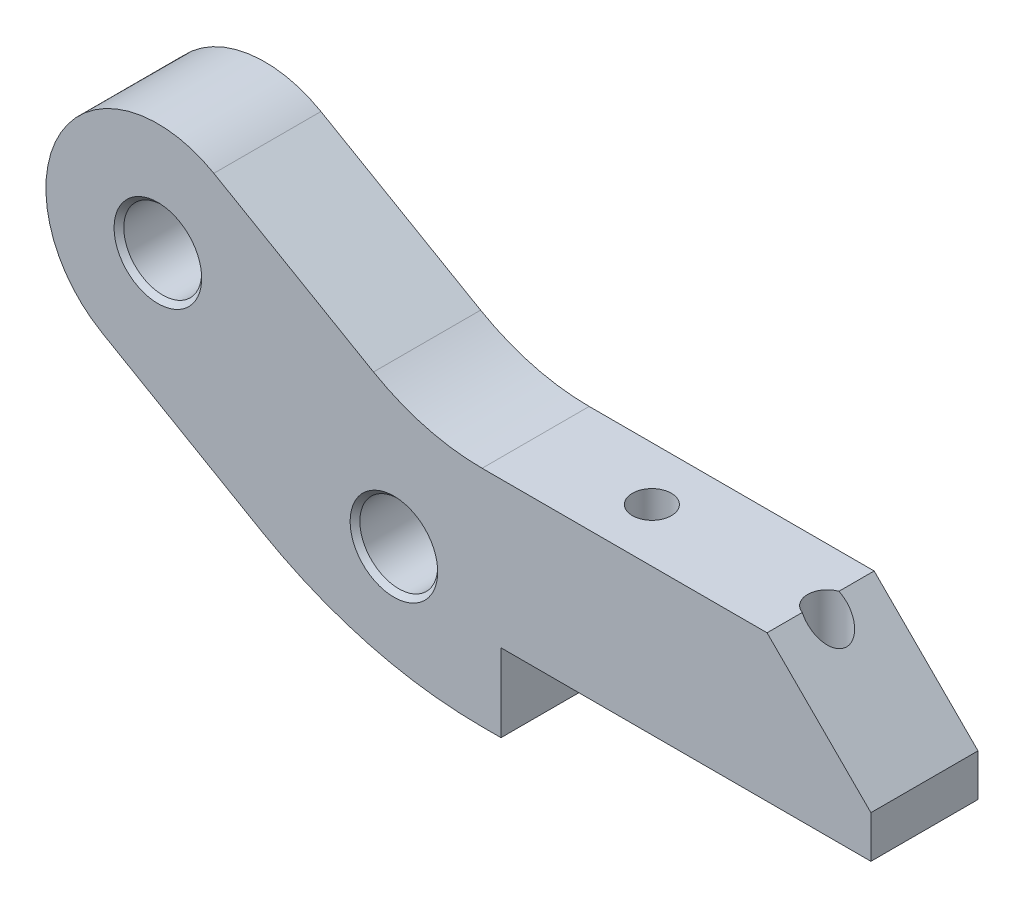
ISO-10303-21;
HEADER;
FILE_DESCRIPTION(('STEP AP214'),'2;1');
FILE_NAME('part.step','',(''),(''),'','','');
FILE_SCHEMA(('AUTOMOTIVE_DESIGN { 1 0 10303 214 1 1 1 1 }'));
ENDSEC;
DATA;
#1=APPLICATION_CONTEXT('core data for automotive mechanical design processes');
#2=APPLICATION_PROTOCOL_DEFINITION('international standard','automotive_design',2000,#1);
#3=PRODUCT_CONTEXT('',#1,'mechanical');
#4=PRODUCT('Part','Part','',(#3));
#5=PRODUCT_RELATED_PRODUCT_CATEGORY('part','',(#4));
#6=PRODUCT_DEFINITION_FORMATION('','',#4);
#7=PRODUCT_DEFINITION_CONTEXT('part definition',#1,'design');
#8=PRODUCT_DEFINITION('design','',#6,#7);
#9=PRODUCT_DEFINITION_SHAPE('','',#8);
#10=(LENGTH_UNIT() NAMED_UNIT(*) SI_UNIT(.MILLI.,.METRE.));
#11=(NAMED_UNIT(*) PLANE_ANGLE_UNIT() SI_UNIT($,.RADIAN.));
#12=(NAMED_UNIT(*) SI_UNIT($,.STERADIAN.) SOLID_ANGLE_UNIT());
#13=UNCERTAINTY_MEASURE_WITH_UNIT(LENGTH_MEASURE(1.E-05),#10,'distance_accuracy_value','');
#14=(GEOMETRIC_REPRESENTATION_CONTEXT(3) GLOBAL_UNCERTAINTY_ASSIGNED_CONTEXT((#13)) GLOBAL_UNIT_ASSIGNED_CONTEXT((#10,
#11,#12)) REPRESENTATION_CONTEXT('',''));
#15=CARTESIAN_POINT('',(0.,0.,0.));
#16=DIRECTION('',(0.,0.,1.));
#17=DIRECTION('',(1.,0.,0.));
#18=AXIS2_PLACEMENT_3D('',#15,#16,#17);
#19=CARTESIAN_POINT('',(23.0592502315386,53.8095821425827,11.));
#20=DIRECTION('',(0.,0.,-1.));
#21=DIRECTION('',(-1.,0.,0.));
#22=AXIS2_PLACEMENT_3D('',#19,#20,#21);
#23=CYLINDRICAL_SURFACE('',#22,22.3095821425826);
#24=CARTESIAN_POINT('',(23.0592502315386,53.8095821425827,0.));
#25=DIRECTION('',(0.,0.,-1.));
#26=DIRECTION('',(-1.,0.,0.));
#27=AXIS2_PLACEMENT_3D('',#24,#25,#26);
#28=CIRCLE('',#27,22.3095821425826);
#29=CARTESIAN_POINT('',(23.0592502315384,31.5000000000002,0.));
#30=VERTEX_POINT('',#29);
#31=CARTESIAN_POINT('',(11.9044591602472,34.4889172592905,0.));
#32=VERTEX_POINT('',#31);
#33=EDGE_CURVE('E191',#30,#32,#28,.T.);
#34=ORIENTED_EDGE('',*,*,#33,.T.);
#35=DIRECTION('',(0.,0.,-1.));
#36=VECTOR('',#35,1.);
#37=CARTESIAN_POINT('',(11.9044591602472,34.4889172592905,11.));
#38=LINE('',#37,#36);
#39=CARTESIAN_POINT('',(11.9044591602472,34.4889172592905,11.));
#40=VERTEX_POINT('',#39);
#41=EDGE_CURVE('E164',#40,#32,#38,.T.);
#42=ORIENTED_EDGE('',*,*,#41,.F.);
#43=CARTESIAN_POINT('',(23.0592502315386,53.8095821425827,11.));
#44=DIRECTION('',(0.,0.,-1.));
#45=DIRECTION('',(-1.,0.,0.));
#46=AXIS2_PLACEMENT_3D('',#43,#44,#45);
#47=CIRCLE('',#46,22.3095821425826);
#48=CARTESIAN_POINT('',(23.0592502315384,31.5000000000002,11.));
#49=VERTEX_POINT('',#48);
#50=EDGE_CURVE('E223',#49,#40,#47,.T.);
#51=ORIENTED_EDGE('',*,*,#50,.F.);
#52=DIRECTION('',(0.,0.,-1.));
#53=VECTOR('',#52,1.);
#54=CARTESIAN_POINT('',(23.0592502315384,31.5000000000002,11.));
#55=LINE('',#54,#53);
#56=EDGE_CURVE('E54',#49,#30,#55,.T.);
#57=ORIENTED_EDGE('',*,*,#56,.T.);
#58=EDGE_LOOP('',(#34,#42,#51,#57));
#59=FACE_BOUND('',#58,.T.);
#60=ADVANCED_FACE('F34',(#59),#23,.F.);
#61=CARTESIAN_POINT('',(11.9044591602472,34.4889172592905,11.));
#62=DIRECTION('',(-0.499999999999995,-0.866025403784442,0.));
#63=DIRECTION('',(0.866025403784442,-0.499999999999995,0.));
#64=AXIS2_PLACEMENT_3D('',#61,#62,#63);
#65=PLANE('',#64);
#66=DIRECTION('',(-0.866025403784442,0.499999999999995,0.));
#67=VECTOR('',#66,1.);
#68=CARTESIAN_POINT('',(11.9044591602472,34.4889172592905,0.));
#69=LINE('',#68,#67);
#70=CARTESIAN_POINT('',(-4.49871130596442,43.9592921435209,0.));
#71=VERTEX_POINT('',#70);
#72=EDGE_CURVE('E195',#32,#71,#69,.T.);
#73=ORIENTED_EDGE('',*,*,#72,.T.);
#74=DIRECTION('',(0.,0.,-1.));
#75=VECTOR('',#74,1.);
#76=CARTESIAN_POINT('',(-4.49871130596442,43.9592921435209,11.));
#77=LINE('',#76,#75);
#78=CARTESIAN_POINT('',(-4.49871130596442,43.9592921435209,11.));
#79=VERTEX_POINT('',#78);
#80=EDGE_CURVE('E161',#79,#71,#77,.T.);
#81=ORIENTED_EDGE('',*,*,#80,.F.);
#82=DIRECTION('',(-0.866025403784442,0.499999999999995,0.));
#83=VECTOR('',#82,1.);
#84=CARTESIAN_POINT('',(11.9044591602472,34.4889172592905,11.));
#85=LINE('',#84,#83);
#86=EDGE_CURVE('E226',#40,#79,#85,.T.);
#87=ORIENTED_EDGE('',*,*,#86,.F.);
#88=ORIENTED_EDGE('',*,*,#41,.T.);
#89=EDGE_LOOP('',(#73,#81,#87,#88));
#90=FACE_BOUND('',#89,.T.);
#91=ADVANCED_FACE('F286',(#90),#65,.F.);
#92=CARTESIAN_POINT('',(-10.2487113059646,34.,11.));
#93=DIRECTION('',(0.,0.,-1.));
#94=DIRECTION('',(-1.,0.,0.));
#95=AXIS2_PLACEMENT_3D('',#92,#93,#94);
#96=CYLINDRICAL_SURFACE('',#95,11.5);
#97=CARTESIAN_POINT('',(-10.2487113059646,34.,0.));
#98=DIRECTION('',(0.,0.,1.));
#99=DIRECTION('',(1.,0.,0.));
#100=AXIS2_PLACEMENT_3D('',#97,#98,#99);
#101=CIRCLE('',#100,11.5);
#102=CARTESIAN_POINT('',(-15.9987113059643,24.0407078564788,0.));
#103=VERTEX_POINT('',#102);
#104=EDGE_CURVE('E204',#71,#103,#101,.T.);
#105=ORIENTED_EDGE('',*,*,#104,.T.);
#106=DIRECTION('',(0.,0.,-1.));
#107=VECTOR('',#106,1.);
#108=CARTESIAN_POINT('',(-15.9987113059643,24.0407078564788,11.));
#109=LINE('',#108,#107);
#110=CARTESIAN_POINT('',(-15.9987113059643,24.0407078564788,11.));
#111=VERTEX_POINT('',#110);
#112=EDGE_CURVE('E158',#111,#103,#109,.T.);
#113=ORIENTED_EDGE('',*,*,#112,.F.);
#114=CARTESIAN_POINT('',(-10.2487113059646,34.,11.));
#115=DIRECTION('',(0.,0.,1.));
#116=DIRECTION('',(1.,0.,0.));
#117=AXIS2_PLACEMENT_3D('',#114,#115,#116);
#118=CIRCLE('',#117,11.5);
#119=EDGE_CURVE('E228',#79,#111,#118,.T.);
#120=ORIENTED_EDGE('',*,*,#119,.F.);
#121=ORIENTED_EDGE('',*,*,#80,.T.);
#122=EDGE_LOOP('',(#105,#113,#120,#121));
#123=FACE_BOUND('',#122,.T.);
#124=ADVANCED_FACE('F282',(#123),#96,.T.);
#125=CARTESIAN_POINT('',(-15.9987113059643,24.0407078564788,11.));
#126=DIRECTION('',(0.499999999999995,0.866025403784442,0.));
#127=DIRECTION('',(-0.866025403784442,0.499999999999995,0.));
#128=AXIS2_PLACEMENT_3D('',#125,#126,#127);
#129=PLANE('',#128);
#130=DIRECTION('',(0.866025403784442,-0.499999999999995,0.));
#131=VECTOR('',#130,1.);
#132=CARTESIAN_POINT('',(-15.9987113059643,24.0407078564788,0.));
#133=LINE('',#132,#131);
#134=CARTESIAN_POINT('',(0.404459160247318,14.5703329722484,0.));
#135=VERTEX_POINT('',#134);
#136=EDGE_CURVE('E206',#103,#135,#133,.T.);
#137=ORIENTED_EDGE('',*,*,#136,.T.);
#138=DIRECTION('',(0.,0.,-1.));
#139=VECTOR('',#138,1.);
#140=CARTESIAN_POINT('',(0.404459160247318,14.5703329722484,11.));
#141=LINE('',#140,#139);
#142=CARTESIAN_POINT('',(0.404459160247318,14.5703329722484,11.));
#143=VERTEX_POINT('',#142);
#144=EDGE_CURVE('E155',#143,#135,#141,.T.);
#145=ORIENTED_EDGE('',*,*,#144,.F.);
#146=DIRECTION('',(0.866025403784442,-0.499999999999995,0.));
#147=VECTOR('',#146,1.);
#148=CARTESIAN_POINT('',(-15.9987113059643,24.0407078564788,11.));
#149=LINE('',#148,#147);
#150=EDGE_CURVE('E230',#111,#143,#149,.T.);
#151=ORIENTED_EDGE('',*,*,#150,.F.);
#152=ORIENTED_EDGE('',*,*,#112,.T.);
#153=EDGE_LOOP('',(#137,#145,#151,#152));
#154=FACE_BOUND('',#153,.T.);
#155=ADVANCED_FACE('F279',(#154),#129,.F.);
#156=CARTESIAN_POINT('',(23.0592502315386,53.8095821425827,11.));
#157=DIRECTION('',(0.,0.,-1.));
#158=DIRECTION('',(-1.,0.,0.));
#159=AXIS2_PLACEMENT_3D('',#156,#157,#158);
#160=CYLINDRICAL_SURFACE('',#159,45.3095821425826);
#161=CARTESIAN_POINT('',(23.0592502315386,53.8095821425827,0.));
#162=DIRECTION('',(0.,0.,1.));
#163=DIRECTION('',(1.,0.,0.));
#164=AXIS2_PLACEMENT_3D('',#161,#162,#163);
#165=CIRCLE('',#164,45.3095821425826);
#166=CARTESIAN_POINT('',(23.0592502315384,8.50000000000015,0.));
#167=VERTEX_POINT('',#166);
#168=EDGE_CURVE('E208',#135,#167,#165,.T.);
#169=ORIENTED_EDGE('',*,*,#168,.T.);
#170=DIRECTION('',(0.,0.,-1.));
#171=VECTOR('',#170,1.);
#172=CARTESIAN_POINT('',(23.0592502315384,8.50000000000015,11.));
#173=LINE('',#172,#171);
#174=CARTESIAN_POINT('',(23.0592502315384,8.50000000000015,11.));
#175=VERTEX_POINT('',#174);
#176=EDGE_CURVE('E152',#175,#167,#173,.T.);
#177=ORIENTED_EDGE('',*,*,#176,.F.);
#178=CARTESIAN_POINT('',(23.0592502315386,53.8095821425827,11.));
#179=DIRECTION('',(0.,0.,1.));
#180=DIRECTION('',(1.,0.,0.));
#181=AXIS2_PLACEMENT_3D('',#178,#179,#180);
#182=CIRCLE('',#181,45.3095821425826);
#183=EDGE_CURVE('E232',#143,#175,#182,.T.);
#184=ORIENTED_EDGE('',*,*,#183,.F.);
#185=ORIENTED_EDGE('',*,*,#144,.T.);
#186=EDGE_LOOP('',(#169,#177,#184,#185));
#187=FACE_BOUND('',#186,.T.);
#188=ADVANCED_FACE('F275',(#187),#160,.T.);
#189=CARTESIAN_POINT('',(23.0592502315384,8.50000000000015,11.));
#190=DIRECTION('',(0.,1.,0.));
#191=DIRECTION('',(-1.,0.,0.));
#192=AXIS2_PLACEMENT_3D('',#189,#190,#191);
#193=PLANE('',#192);
#194=DIRECTION('',(1.,0.,0.));
#195=VECTOR('',#194,1.);
#196=CARTESIAN_POINT('',(23.0592502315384,8.50000000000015,0.));
#197=LINE('',#196,#195);
#198=CARTESIAN_POINT('',(25.,8.5,0.));
#199=VERTEX_POINT('',#198);
#200=EDGE_CURVE('E210',#167,#199,#197,.T.);
#201=ORIENTED_EDGE('',*,*,#200,.T.);
#202=DIRECTION('',(0.,0.,-1.));
#203=VECTOR('',#202,1.);
#204=CARTESIAN_POINT('',(25.,8.5,11.));
#205=LINE('',#204,#203);
#206=CARTESIAN_POINT('',(25.,8.5,11.));
#207=VERTEX_POINT('',#206);
#208=EDGE_CURVE('E149',#207,#199,#205,.T.);
#209=ORIENTED_EDGE('',*,*,#208,.F.);
#210=DIRECTION('',(1.,0.,0.));
#211=VECTOR('',#210,1.);
#212=CARTESIAN_POINT('',(23.0592502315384,8.50000000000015,11.));
#213=LINE('',#212,#211);
#214=EDGE_CURVE('E234',#175,#207,#213,.T.);
#215=ORIENTED_EDGE('',*,*,#214,.F.);
#216=ORIENTED_EDGE('',*,*,#176,.T.);
#217=EDGE_LOOP('',(#201,#209,#215,#216));
#218=FACE_BOUND('',#217,.T.);
#219=ADVANCED_FACE('F270',(#218),#193,.F.);
#220=CARTESIAN_POINT('',(25.,8.5,11.));
#221=DIRECTION('',(-1.,0.,0.));
#222=DIRECTION('',(0.,0.,1.));
#223=AXIS2_PLACEMENT_3D('',#220,#221,#222);
#224=PLANE('',#223);
#225=DIRECTION('',(0.,1.,0.));
#226=VECTOR('',#225,1.);
#227=CARTESIAN_POINT('',(25.,8.5,0.));
#228=LINE('',#227,#226);
#229=CARTESIAN_POINT('',(25.,16.5,0.));
#230=VERTEX_POINT('',#229);
#231=EDGE_CURVE('E212',#199,#230,#228,.T.);
#232=ORIENTED_EDGE('',*,*,#231,.T.);
#233=DIRECTION('',(0.,0.,-1.));
#234=VECTOR('',#233,1.);
#235=CARTESIAN_POINT('',(25.,16.5,11.));
#236=LINE('',#235,#234);
#237=CARTESIAN_POINT('',(25.,16.5,11.));
#238=VERTEX_POINT('',#237);
#239=EDGE_CURVE('E146',#238,#230,#236,.T.);
#240=ORIENTED_EDGE('',*,*,#239,.F.);
#241=DIRECTION('',(0.,1.,0.));
#242=VECTOR('',#241,1.);
#243=CARTESIAN_POINT('',(25.,8.5,11.));
#244=LINE('',#243,#242);
#245=EDGE_CURVE('E236',#207,#238,#244,.T.);
#246=ORIENTED_EDGE('',*,*,#245,.F.);
#247=ORIENTED_EDGE('',*,*,#208,.T.);
#248=EDGE_LOOP('',(#232,#240,#246,#247));
#249=FACE_BOUND('',#248,.T.);
#250=ADVANCED_FACE('F264',(#249),#224,.F.);
#251=CARTESIAN_POINT('',(25.,16.5,11.));
#252=DIRECTION('',(0.,1.,0.));
#253=DIRECTION('',(-1.,0.,0.));
#254=AXIS2_PLACEMENT_3D('',#251,#252,#253);
#255=PLANE('',#254);
#256=CARTESIAN_POINT('',(52.9999999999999,16.4999999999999,5.5));
#257=DIRECTION('',(0.,-1.,0.));
#258=DIRECTION('',(0.,0.,-1.));
#259=AXIS2_PLACEMENT_3D('',#256,#257,#258);
#260=CIRCLE('',#259,2.);
#261=CARTESIAN_POINT('',(52.9999999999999,16.4999999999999,3.5));
#262=VERTEX_POINT('',#261);
#263=EDGE_CURVE('E130',#262,#262,#260,.T.);
#264=ORIENTED_EDGE('',*,*,#263,.F.);
#265=EDGE_LOOP('',(#264));
#266=FACE_BOUND('',#265,.T.);
#267=CARTESIAN_POINT('',(34.9999999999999,16.4999999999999,5.5));
#268=DIRECTION('',(0.,-1.,0.));
#269=DIRECTION('',(0.,0.,-1.));
#270=AXIS2_PLACEMENT_3D('',#267,#268,#269);
#271=CIRCLE('',#270,2.);
#272=CARTESIAN_POINT('',(34.9999999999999,16.4999999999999,3.5));
#273=VERTEX_POINT('',#272);
#274=EDGE_CURVE('E129',#273,#273,#271,.T.);
#275=ORIENTED_EDGE('',*,*,#274,.F.);
#276=EDGE_LOOP('',(#275));
#277=FACE_BOUND('',#276,.T.);
#278=DIRECTION('',(1.,0.,0.));
#279=VECTOR('',#278,1.);
#280=CARTESIAN_POINT('',(25.,16.5,0.));
#281=LINE('',#280,#279);
#282=CARTESIAN_POINT('',(62.9999999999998,16.5000000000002,0.));
#283=VERTEX_POINT('',#282);
#284=EDGE_CURVE('E214',#230,#283,#281,.T.);
#285=ORIENTED_EDGE('',*,*,#284,.T.);
#286=DIRECTION('',(0.,0.,-1.));
#287=VECTOR('',#286,1.);
#288=CARTESIAN_POINT('',(62.9999999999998,16.5000000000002,11.));
#289=LINE('',#288,#287);
#290=CARTESIAN_POINT('',(62.9999999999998,16.5000000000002,11.));
#291=VERTEX_POINT('',#290);
#292=EDGE_CURVE('E139',#291,#283,#289,.T.);
#293=ORIENTED_EDGE('',*,*,#292,.F.);
#294=DIRECTION('',(1.,0.,0.));
#295=VECTOR('',#294,1.);
#296=CARTESIAN_POINT('',(25.,16.5,11.));
#297=LINE('',#296,#295);
#298=EDGE_CURVE('E238',#238,#291,#297,.T.);
#299=ORIENTED_EDGE('',*,*,#298,.F.);
#300=ORIENTED_EDGE('',*,*,#239,.T.);
#301=EDGE_LOOP('',(#285,#293,#299,#300));
#302=FACE_BOUND('',#301,.T.);
#303=ADVANCED_FACE('F260',(#266,#277,#302),#255,.F.);
#304=CARTESIAN_POINT('',(62.9999999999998,16.5000000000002,11.));
#305=DIRECTION('',(-1.,0.,0.));
#306=DIRECTION('',(0.,0.,1.));
#307=AXIS2_PLACEMENT_3D('',#304,#305,#306);
#308=PLANE('',#307);
#309=DIRECTION('',(0.,1.,0.));
#310=VECTOR('',#309,1.);
#311=CARTESIAN_POINT('',(62.9999999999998,16.5000000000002,0.));
#312=LINE('',#311,#310);
#313=CARTESIAN_POINT('',(62.9999999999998,20.8311911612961,0.));
#314=VERTEX_POINT('',#313);
#315=EDGE_CURVE('E216',#283,#314,#312,.T.);
#316=ORIENTED_EDGE('',*,*,#315,.T.);
#317=DIRECTION('',(0.,0.,-1.));
#318=VECTOR('',#317,1.);
#319=CARTESIAN_POINT('',(62.9999999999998,20.8311911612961,11.));
#320=LINE('',#319,#318);
#321=CARTESIAN_POINT('',(62.9999999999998,20.8311911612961,11.));
#322=VERTEX_POINT('',#321);
#323=EDGE_CURVE('E136',#322,#314,#320,.T.);
#324=ORIENTED_EDGE('',*,*,#323,.F.);
#325=DIRECTION('',(0.,1.,0.));
#326=VECTOR('',#325,1.);
#327=CARTESIAN_POINT('',(62.9999999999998,16.5000000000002,11.));
#328=LINE('',#327,#326);
#329=EDGE_CURVE('E240',#291,#322,#328,.T.);
#330=ORIENTED_EDGE('',*,*,#329,.F.);
#331=ORIENTED_EDGE('',*,*,#292,.T.);
#332=EDGE_LOOP('',(#316,#324,#330,#331));
#333=FACE_BOUND('',#332,.T.);
#334=ADVANCED_FACE('F255',(#333),#308,.F.);
#335=CARTESIAN_POINT('',(62.9999999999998,20.8311911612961,11.));
#336=DIRECTION('',(-0.707106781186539,-0.707106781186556,0.));
#337=DIRECTION('',(0.707106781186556,-0.707106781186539,0.));
#338=AXIS2_PLACEMENT_3D('',#335,#336,#337);
#339=PLANE('',#338);
#340=DIRECTION('',(0.,0.,-1.));
#341=VECTOR('',#340,1.);
#342=CARTESIAN_POINT('',(52.3311911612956,31.5,11.));
#343=LINE('',#342,#341);
#344=CARTESIAN_POINT('',(52.3311911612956,31.5,3.61514065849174));
#345=VERTEX_POINT('',#344);
#346=CARTESIAN_POINT('',(52.3311911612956,31.5,0.));
#347=VERTEX_POINT('',#346);
#348=EDGE_CURVE('E128',#345,#347,#343,.T.);
#349=ORIENTED_EDGE('',*,*,#348,.F.);
#350=CARTESIAN_POINT('',(52.9999999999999,30.8311911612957,5.5));
#351=DIRECTION('',(-0.707106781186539,-0.707106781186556,0.));
#352=DIRECTION('',(0.707106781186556,-0.707106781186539,0.));
#353=AXIS2_PLACEMENT_3D('',#350,#351,#352);
#354=ELLIPSE('',#353,2.82842712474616,2.);
#355=CARTESIAN_POINT('',(52.3311911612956,31.5,7.38485934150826));
#356=VERTEX_POINT('',#355);
#357=EDGE_CURVE('E46',#345,#356,#354,.T.);
#358=ORIENTED_EDGE('',*,*,#357,.T.);
#359=CARTESIAN_POINT('',(52.3311911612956,31.5,11.));
#360=VERTEX_POINT('',#359);
#361=EDGE_CURVE('E126',#360,#356,#343,.T.);
#362=ORIENTED_EDGE('',*,*,#361,.F.);
#363=DIRECTION('',(-0.707106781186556,0.707106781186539,0.));
#364=VECTOR('',#363,1.);
#365=CARTESIAN_POINT('',(62.9999999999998,20.8311911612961,11.));
#366=LINE('',#365,#364);
#367=EDGE_CURVE('E242',#322,#360,#366,.T.);
#368=ORIENTED_EDGE('',*,*,#367,.F.);
#369=ORIENTED_EDGE('',*,*,#323,.T.);
#370=DIRECTION('',(-0.707106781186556,0.707106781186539,0.));
#371=VECTOR('',#370,1.);
#372=CARTESIAN_POINT('',(62.9999999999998,20.8311911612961,0.));
#373=LINE('',#372,#371);
#374=EDGE_CURVE('E218',#314,#347,#373,.T.);
#375=ORIENTED_EDGE('',*,*,#374,.T.);
#376=EDGE_LOOP('',(#349,#358,#362,#368,#369,#375));
#377=FACE_BOUND('',#376,.T.);
#378=ADVANCED_FACE('F124',(#377),#339,.F.);
#379=CARTESIAN_POINT('',(23.0592502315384,31.5000000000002,11.));
#380=DIRECTION('',(0.,1.,0.));
#381=DIRECTION('',(-1.,0.,0.));
#382=AXIS2_PLACEMENT_3D('',#379,#380,#381);
#383=PLANE('',#382);
#384=CARTESIAN_POINT('',(52.9999999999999,31.5,5.5));
#385=DIRECTION('',(0.,1.,0.));
#386=DIRECTION('',(-1.,0.,0.));
#387=AXIS2_PLACEMENT_3D('',#384,#385,#386);
#388=CIRCLE('',#387,2.);
#389=EDGE_CURVE('E11',#345,#356,#388,.T.);
#390=ORIENTED_EDGE('',*,*,#389,.F.);
#391=ORIENTED_EDGE('',*,*,#348,.T.);
#392=DIRECTION('',(1.,0.,0.));
#393=VECTOR('',#392,1.);
#394=CARTESIAN_POINT('',(23.0592502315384,31.5000000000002,0.));
#395=LINE('',#394,#393);
#396=EDGE_CURVE('E220',#30,#347,#395,.T.);
#397=ORIENTED_EDGE('',*,*,#396,.F.);
#398=ORIENTED_EDGE('',*,*,#56,.F.);
#399=DIRECTION('',(1.,0.,0.));
#400=VECTOR('',#399,1.);
#401=CARTESIAN_POINT('',(23.0592502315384,31.5000000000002,11.));
#402=LINE('',#401,#400);
#403=EDGE_CURVE('E135',#49,#360,#402,.T.);
#404=ORIENTED_EDGE('',*,*,#403,.T.);
#405=ORIENTED_EDGE('',*,*,#361,.T.);
#406=EDGE_LOOP('',(#390,#391,#397,#398,#404,#405));
#407=FACE_BOUND('',#406,.T.);
#408=CARTESIAN_POINT('',(34.9999999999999,31.5000000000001,5.5));
#409=DIRECTION('',(0.,1.,0.));
#410=DIRECTION('',(-1.,0.,0.));
#411=AXIS2_PLACEMENT_3D('',#408,#409,#410);
#412=CIRCLE('',#411,2.);
#413=CARTESIAN_POINT('',(32.9999999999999,31.5000000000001,5.5));
#414=VERTEX_POINT('',#413);
#415=EDGE_CURVE('E189',#414,#414,#412,.T.);
#416=ORIENTED_EDGE('',*,*,#415,.F.);
#417=EDGE_LOOP('',(#416));
#418=FACE_BOUND('',#417,.T.);
#419=ADVANCED_FACE('F132',(#407,#418),#383,.T.);
#420=CARTESIAN_POINT('',(23.0592502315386,53.8095821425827,11.));
#421=DIRECTION('',(0.,0.,-1.));
#422=DIRECTION('',(-1.,0.,0.));
#423=AXIS2_PLACEMENT_3D('',#420,#421,#422);
#424=PLANE('',#423);
#425=CARTESIAN_POINT('',(14.,20.,11.));
#426=DIRECTION('',(0.,0.,-1.));
#427=DIRECTION('',(-1.,0.,0.));
#428=AXIS2_PLACEMENT_3D('',#425,#426,#427);
#429=CIRCLE('',#428,4.50000000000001);
#430=CARTESIAN_POINT('',(9.49999999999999,20.,11.));
#431=VERTEX_POINT('',#430);
#432=EDGE_CURVE('E185',#431,#431,#429,.T.);
#433=ORIENTED_EDGE('',*,*,#432,.T.);
#434=EDGE_LOOP('',(#433));
#435=FACE_BOUND('',#434,.T.);
#436=CARTESIAN_POINT('',(-10.2487113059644,33.9999999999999,11.));
#437=DIRECTION('',(0.,0.,-1.));
#438=DIRECTION('',(-1.,0.,0.));
#439=AXIS2_PLACEMENT_3D('',#436,#437,#438);
#440=CIRCLE('',#439,4.50000000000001);
#441=CARTESIAN_POINT('',(-14.7487113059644,33.9999999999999,11.));
#442=VERTEX_POINT('',#441);
#443=EDGE_CURVE('E173',#442,#442,#440,.T.);
#444=ORIENTED_EDGE('',*,*,#443,.T.);
#445=EDGE_LOOP('',(#444));
#446=FACE_BOUND('',#445,.T.);
#447=ORIENTED_EDGE('',*,*,#50,.T.);
#448=ORIENTED_EDGE('',*,*,#86,.T.);
#449=ORIENTED_EDGE('',*,*,#119,.T.);
#450=ORIENTED_EDGE('',*,*,#150,.T.);
#451=ORIENTED_EDGE('',*,*,#183,.T.);
#452=ORIENTED_EDGE('',*,*,#214,.T.);
#453=ORIENTED_EDGE('',*,*,#245,.T.);
#454=ORIENTED_EDGE('',*,*,#298,.T.);
#455=ORIENTED_EDGE('',*,*,#329,.T.);
#456=ORIENTED_EDGE('',*,*,#367,.T.);
#457=ORIENTED_EDGE('',*,*,#403,.F.);
#458=EDGE_LOOP('',(#447,#448,#449,#450,#451,#452,#453,#454,#455,#456,#457));
#459=FACE_BOUND('',#458,.T.);
#460=ADVANCED_FACE('F288',(#435,#446,#459),#424,.F.);
#461=CARTESIAN_POINT('',(23.0592502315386,53.8095821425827,0.));
#462=DIRECTION('',(0.,0.,-1.));
#463=DIRECTION('',(-1.,0.,0.));
#464=AXIS2_PLACEMENT_3D('',#461,#462,#463);
#465=PLANE('',#464);
#466=CARTESIAN_POINT('',(14.,20.,0.));
#467=DIRECTION('',(0.,0.,-1.));
#468=DIRECTION('',(-1.,0.,0.));
#469=AXIS2_PLACEMENT_3D('',#466,#467,#468);
#470=CIRCLE('',#469,4.50000000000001);
#471=CARTESIAN_POINT('',(9.49999999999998,20.,0.));
#472=VERTEX_POINT('',#471);
#473=EDGE_CURVE('E41',#472,#472,#470,.F.);
#474=ORIENTED_EDGE('',*,*,#473,.T.);
#475=EDGE_LOOP('',(#474));
#476=FACE_BOUND('',#475,.T.);
#477=CARTESIAN_POINT('',(-10.2487113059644,33.9999999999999,0.));
#478=DIRECTION('',(0.,0.,-1.));
#479=DIRECTION('',(-1.,0.,0.));
#480=AXIS2_PLACEMENT_3D('',#477,#478,#479);
#481=CIRCLE('',#480,4.50000000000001);
#482=CARTESIAN_POINT('',(-14.7487113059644,33.9999999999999,0.));
#483=VERTEX_POINT('',#482);
#484=EDGE_CURVE('E176',#483,#483,#481,.F.);
#485=ORIENTED_EDGE('',*,*,#484,.T.);
#486=EDGE_LOOP('',(#485));
#487=FACE_BOUND('',#486,.T.);
#488=ORIENTED_EDGE('',*,*,#33,.F.);
#489=ORIENTED_EDGE('',*,*,#396,.T.);
#490=ORIENTED_EDGE('',*,*,#374,.F.);
#491=ORIENTED_EDGE('',*,*,#315,.F.);
#492=ORIENTED_EDGE('',*,*,#284,.F.);
#493=ORIENTED_EDGE('',*,*,#231,.F.);
#494=ORIENTED_EDGE('',*,*,#200,.F.);
#495=ORIENTED_EDGE('',*,*,#168,.F.);
#496=ORIENTED_EDGE('',*,*,#136,.F.);
#497=ORIENTED_EDGE('',*,*,#104,.F.);
#498=ORIENTED_EDGE('',*,*,#72,.F.);
#499=EDGE_LOOP('',(#488,#489,#490,#491,#492,#493,#494,#495,#496,#497,#498));
#500=FACE_BOUND('',#499,.T.);
#501=ADVANCED_FACE('F247',(#476,#487,#500),#465,.T.);
#502=CARTESIAN_POINT('',(-10.2487113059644,33.9999999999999,0.));
#503=DIRECTION('',(0.,0.,1.));
#504=DIRECTION('',(1.,0.,0.));
#505=AXIS2_PLACEMENT_3D('',#502,#503,#504);
#506=CYLINDRICAL_SURFACE('',#505,4.);
#507=CARTESIAN_POINT('',(-10.2487113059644,33.9999999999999,10.5));
#508=DIRECTION('',(0.,0.,-1.));
#509=DIRECTION('',(-1.,0.,0.));
#510=AXIS2_PLACEMENT_3D('',#507,#508,#509);
#511=CIRCLE('',#510,4.);
#512=CARTESIAN_POINT('',(-14.2487113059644,33.9999999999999,10.5));
#513=VERTEX_POINT('',#512);
#514=EDGE_CURVE('E170',#513,#513,#511,.F.);
#515=ORIENTED_EDGE('',*,*,#514,.T.);
#516=EDGE_LOOP('',(#515));
#517=FACE_BOUND('',#516,.T.);
#518=CARTESIAN_POINT('',(-10.2487113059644,33.9999999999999,0.500000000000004));
#519=DIRECTION('',(0.,0.,-1.));
#520=DIRECTION('',(-1.,0.,0.));
#521=AXIS2_PLACEMENT_3D('',#518,#519,#520);
#522=CIRCLE('',#521,4.);
#523=CARTESIAN_POINT('',(-14.2487113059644,33.9999999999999,0.500000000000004));
#524=VERTEX_POINT('',#523);
#525=EDGE_CURVE('E167',#524,#524,#522,.T.);
#526=ORIENTED_EDGE('',*,*,#525,.T.);
#527=EDGE_LOOP('',(#526));
#528=FACE_BOUND('',#527,.T.);
#529=ADVANCED_FACE('F296',(#517,#528),#506,.F.);
#530=CARTESIAN_POINT('',(-10.2487113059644,33.9999999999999,10.5));
#531=DIRECTION('',(0.,0.,1.));
#532=DIRECTION('',(1.,0.,0.));
#533=AXIS2_PLACEMENT_3D('',#530,#531,#532);
#534=CONICAL_SURFACE('',#533,4.,0.785398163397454);
#535=ORIENTED_EDGE('',*,*,#443,.F.);
#536=EDGE_LOOP('',(#535));
#537=FACE_BOUND('',#536,.T.);
#538=ORIENTED_EDGE('',*,*,#514,.F.);
#539=EDGE_LOOP('',(#538));
#540=FACE_BOUND('',#539,.T.);
#541=ADVANCED_FACE('F374',(#537,#540),#534,.F.);
#542=CARTESIAN_POINT('',(-10.2487113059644,33.9999999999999,0.));
#543=DIRECTION('',(0.,0.,-1.));
#544=DIRECTION('',(-1.,0.,0.));
#545=AXIS2_PLACEMENT_3D('',#542,#543,#544);
#546=CONICAL_SURFACE('',#545,4.50000000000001,0.785398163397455);
#547=ORIENTED_EDGE('',*,*,#525,.F.);
#548=EDGE_LOOP('',(#547));
#549=FACE_BOUND('',#548,.T.);
#550=ORIENTED_EDGE('',*,*,#484,.F.);
#551=EDGE_LOOP('',(#550));
#552=FACE_BOUND('',#551,.T.);
#553=ADVANCED_FACE('F370',(#549,#552),#546,.F.);
#554=CARTESIAN_POINT('',(14.,20.,0.));
#555=DIRECTION('',(0.,0.,1.));
#556=DIRECTION('',(1.,0.,0.));
#557=AXIS2_PLACEMENT_3D('',#554,#555,#556);
#558=CYLINDRICAL_SURFACE('',#557,4.);
#559=CARTESIAN_POINT('',(14.,20.,10.5));
#560=DIRECTION('',(0.,0.,-1.));
#561=DIRECTION('',(-1.,0.,0.));
#562=AXIS2_PLACEMENT_3D('',#559,#560,#561);
#563=CIRCLE('',#562,4.);
#564=CARTESIAN_POINT('',(9.99999999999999,20.,10.5));
#565=VERTEX_POINT('',#564);
#566=EDGE_CURVE('E182',#565,#565,#563,.F.);
#567=ORIENTED_EDGE('',*,*,#566,.T.);
#568=EDGE_LOOP('',(#567));
#569=FACE_BOUND('',#568,.T.);
#570=CARTESIAN_POINT('',(14.,20.,0.500000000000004));
#571=DIRECTION('',(0.,0.,-1.));
#572=DIRECTION('',(-1.,0.,0.));
#573=AXIS2_PLACEMENT_3D('',#570,#571,#572);
#574=CIRCLE('',#573,4.);
#575=CARTESIAN_POINT('',(9.99999999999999,20.,0.500000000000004));
#576=VERTEX_POINT('',#575);
#577=EDGE_CURVE('E179',#576,#576,#574,.T.);
#578=ORIENTED_EDGE('',*,*,#577,.T.);
#579=EDGE_LOOP('',(#578));
#580=FACE_BOUND('',#579,.T.);
#581=ADVANCED_FACE('F366',(#569,#580),#558,.F.);
#582=CARTESIAN_POINT('',(14.,20.,10.5));
#583=DIRECTION('',(0.,0.,1.));
#584=DIRECTION('',(1.,0.,0.));
#585=AXIS2_PLACEMENT_3D('',#582,#583,#584);
#586=CONICAL_SURFACE('',#585,4.,0.785398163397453);
#587=ORIENTED_EDGE('',*,*,#432,.F.);
#588=EDGE_LOOP('',(#587));
#589=FACE_BOUND('',#588,.T.);
#590=ORIENTED_EDGE('',*,*,#566,.F.);
#591=EDGE_LOOP('',(#590));
#592=FACE_BOUND('',#591,.T.);
#593=ADVANCED_FACE('F362',(#589,#592),#586,.F.);
#594=CARTESIAN_POINT('',(14.,20.,0.));
#595=DIRECTION('',(0.,0.,-1.));
#596=DIRECTION('',(-1.,0.,0.));
#597=AXIS2_PLACEMENT_3D('',#594,#595,#596);
#598=CONICAL_SURFACE('',#597,4.50000000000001,0.785398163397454);
#599=ORIENTED_EDGE('',*,*,#577,.F.);
#600=EDGE_LOOP('',(#599));
#601=FACE_BOUND('',#600,.T.);
#602=ORIENTED_EDGE('',*,*,#473,.F.);
#603=EDGE_LOOP('',(#602));
#604=FACE_BOUND('',#603,.T.);
#605=ADVANCED_FACE('F344',(#601,#604),#598,.F.);
#606=CARTESIAN_POINT('',(34.9999999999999,38.3492352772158,5.5));
#607=DIRECTION('',(0.,-1.,0.));
#608=DIRECTION('',(0.,0.,-1.));
#609=AXIS2_PLACEMENT_3D('',#606,#607,#608);
#610=CYLINDRICAL_SURFACE('',#609,2.);
#611=ORIENTED_EDGE('',*,*,#415,.T.);
#612=EDGE_LOOP('',(#611));
#613=FACE_BOUND('',#612,.T.);
#614=ORIENTED_EDGE('',*,*,#274,.T.);
#615=EDGE_LOOP('',(#614));
#616=FACE_BOUND('',#615,.T.);
#617=ADVANCED_FACE('F339',(#613,#616),#610,.F.);
#618=CARTESIAN_POINT('',(52.9999999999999,38.3492352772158,5.5));
#619=DIRECTION('',(0.,-1.,0.));
#620=DIRECTION('',(0.,0.,-1.));
#621=AXIS2_PLACEMENT_3D('',#618,#619,#620);
#622=CYLINDRICAL_SURFACE('',#621,2.);
#623=ORIENTED_EDGE('',*,*,#263,.T.);
#624=EDGE_LOOP('',(#623));
#625=FACE_BOUND('',#624,.T.);
#626=ORIENTED_EDGE('',*,*,#389,.T.);
#627=ORIENTED_EDGE('',*,*,#357,.F.);
#628=EDGE_LOOP('',(#626,#627));
#629=FACE_BOUND('',#628,.T.);
#630=ADVANCED_FACE('F119',(#625,#629),#622,.F.);
#631=CLOSED_SHELL('',(#60,#91,#124,#155,#188,#219,#250,#303,#334,#378,#419,#460,#501,#529,#541,
#553,#581,#593,#605,#617,#630));
#632=MANIFOLD_SOLID_BREP('B2',#631);
#633=ADVANCED_BREP_SHAPE_REPRESENTATION('',(#18,#632),#14);
#634=SHAPE_DEFINITION_REPRESENTATION(#9,#633);
ENDSEC;
END-ISO-10303-21;
